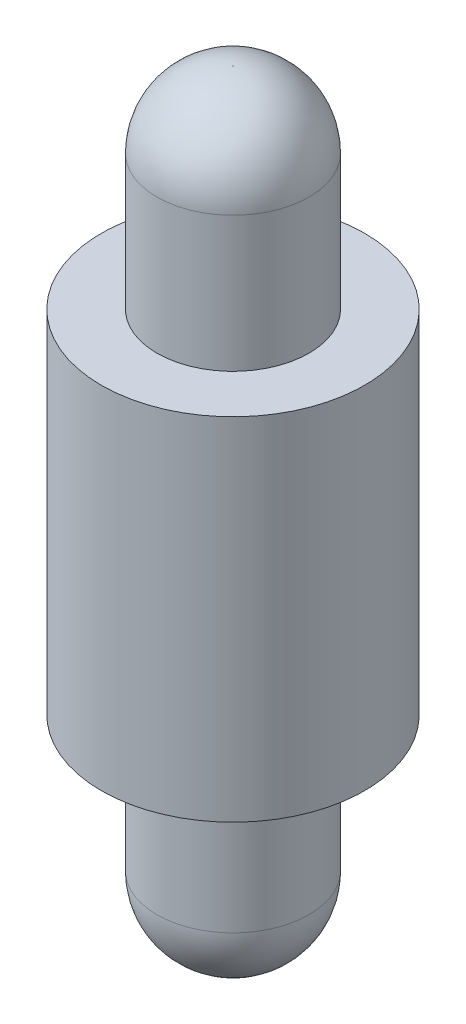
from build123d import *

# Parameters (mm, degrees)
ESQUISSE1_R      = 2.25
EXTRUSION1_DEPTH = 6
ESQUISSE2_R      = 1.3
EXTRUSION2_DEPTH = 3.6
EXTRUSION3_START = 3.6
ESQUISSE3_R      = 1.3
EXTRUSION3_DEPTH = 3.6
CONG_1_R         = 1.29


with BuildPart() as part:
    # Esquisse1 → Extrusion1 (new body)
    with BuildSketch(Plane(origin=(0, 0, 0), x_dir=(1, 0, 0), z_dir=(0, 1, 0))):
        with Locations(Location((0, 0, 0), (0, 0, 270))):
            Circle(ESQUISSE1_R)
    extrude(amount=EXTRUSION1_DEPTH)

    # Esquisse2 → Extrusion2 (add)
    with BuildSketch(Plane.XZ):
        with Locations(Location((0, 0, 0), (0, 0, 90))):
            Circle(ESQUISSE2_R)
    extrude(amount=EXTRUSION2_DEPTH)

    # Esquisse3 → Extrusion3 (add)
    with BuildSketch(Plane(origin=(0, 6, 0), x_dir=(-1, 0, 0), z_dir=(0, 1, 0)).offset(EXTRUSION3_START)):
        with Locations(Location((0, 0, 0), (0, 0, 90))):
            Circle(ESQUISSE3_R)
    extrude(amount=-EXTRUSION3_DEPTH)

    # Cong_1
    cong_1_edges = [part.edges().sort_by_distance(p)[0] for p in [
        (0, 9.6, -1.3),
        (0, -3.6, -1.3),
    ]]
    fillet(cong_1_edges, radius=CONG_1_R)


solid = part.part
